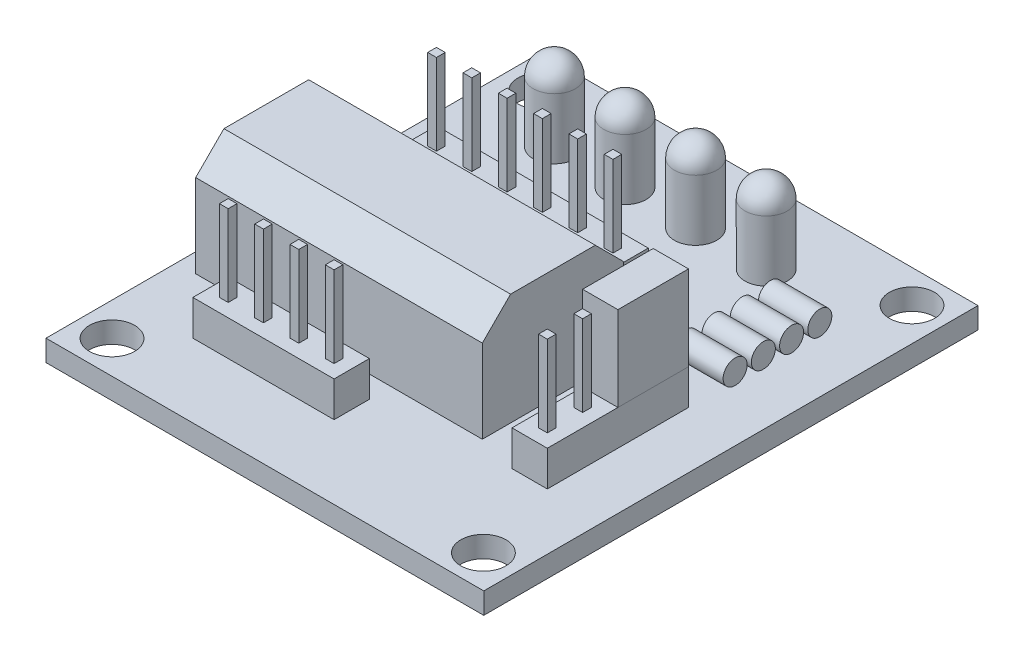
from build123d import *

# Parameters (mm, degrees)
SKETCH1_W              = 31
SKETCH1_H              = 35
SKETCH1_R              = 1.6
BOSS_EXTRUDE1_DEPTH    = 1.5
SKETCH2_W              = 20.3
SKETCH2_H              = 10
BOSS_EXTRUDE2_DEPTH    = 7.9
SKETCH3_R              = 1.5
BOSS_EXTRUDE3_DEPTH    = 5.8
FILLET1_R              = 1.5
LPATTERN1_COUNT        = 4
LPATTERN1_PITCH        = 5
FILLET1_OF_LPATTERN1_R = 1.5
BOSS_EXTRUDE4_START    = -3.7
SKETCH4_R              = 0.85
BOSS_EXTRUDE4_DEPTH    = 3.5
LPATTERN2_COUNT        = 4
LPATTERN2_PITCH        = 2
CHAMFER1_SIZE          = 2
SKETCH5_W              = 2.5
SKETCH5_H              = 2.5
BOSS_EXTRUDE5_DEPTH    = 2.5
SKETCH6_W              = 0.62
SKETCH6_H              = 0.62
BOSS_EXTRUDE6_DEPTH    = 5.75
SKETCH7_W              = 2.5
SKETCH7_H              = 2.5
BOSS_EXTRUDE7_DEPTH    = 2.5
SKETCH8_W              = 0.62
SKETCH8_H              = 0.62
BOSS_EXTRUDE8_DEPTH    = 5.75
SKETCH9_W              = 2.5
SKETCH9_H              = 2.5
BOSS_EXTRUDE9_DEPTH    = 2.5
SKETCH10_W             = 0.62
SKETCH10_H             = 0.62
BOSS_EXTRUDE10_DEPTH   = 5.75
LPATTERN3_COUNT        = 4
LPATTERN3_PITCH        = 2.5
LPATTERN4_COUNT        = 4
LPATTERN4_PITCH        = 2.5
LPATTERN5_COUNT        = 6
LPATTERN5_PITCH        = 2.5
SKETCH11_W             = 2.5
SKETCH11_H             = 5
BOSS_EXTRUDE11_DEPTH   = 6


with BuildPart() as part:
    # Sketch1 → Boss-Extrude1 (new body)
    with BuildSketch(Plane(origin=(0, 0, 0), x_dir=(1, 0, 0), z_dir=(0, 1, 0))):
        Rectangle(SKETCH1_W, SKETCH1_H)
        with Locations(Location((-13.15, 15.175, 0), (0, 0, 270))):
            Circle(SKETCH1_R, mode=Mode.SUBTRACT)
        with Locations(Location((13.15, 15.175, 0), (0, 0, 270))):
            Circle(SKETCH1_R, mode=Mode.SUBTRACT)
        with Locations(Location((13.15, -15.175, 0), (0, 0, 270))):
            Circle(SKETCH1_R, mode=Mode.SUBTRACT)
        with Locations(Location((-13.15, -15.175, 0), (0, 0, 270))):
            Circle(SKETCH1_R, mode=Mode.SUBTRACT)
    extrude(amount=BOSS_EXTRUDE1_DEPTH)

    # Sketch2 → Boss-Extrude2 (add)
    with BuildSketch(Plane(origin=(0, 1.5, 0), x_dir=(1, 0, 0), z_dir=(0, 1, 0))):
        with Locations((-4, -3.25)):
            Rectangle(SKETCH2_W, SKETCH2_H)
    extrude(amount=BOSS_EXTRUDE2_DEPTH)

    # Sketch3 → Boss-Extrude3 (add)
    with BuildSketch(Plane(origin=(0, 1.5, 0), x_dir=(1, 0, 0), z_dir=(0, 1, 0))):
        with Locations(Location((-9.25, 12.25, 0), (0, 0, 270))):
            Circle(SKETCH3_R)
    boss_extrude3 = extrude(amount=BOSS_EXTRUDE3_DEPTH)

    # Fillet1
    fillet1_edges = [part.edges().sort_by_distance(p)[0] for p in [
        (-9.25, 7.3, -13.75),
    ]]
    fillet(fillet1_edges, radius=FILLET1_R)

    # LPattern1: Boss-Extrude3 ×4
    with Locations(*[(i * LPATTERN1_PITCH, 0, 0) for i in range(1, LPATTERN1_COUNT)]):
        add(boss_extrude3)

    # Fillet1 of LPattern1
    fillet1_of_lpattern1_edges = [part.edges().sort_by_distance(p)[0] for p in [
        (-4.25, 7.3, -13.75),
        (0.75, 7.3, -13.75),
        (5.75, 7.3, -13.75),
    ]]
    fillet(fillet1_of_lpattern1_edges, radius=FILLET1_OF_LPATTERN1_R)

    # Sketch4 → Boss-Extrude4 (add)
    with BuildSketch(Plane(origin=(15.5, 0, 0), x_dir=(0, 0, -1), z_dir=(1, 0, 0)).offset(BOSS_EXTRUDE4_START)):
        with Locations((10, 2.34)):
            Circle(SKETCH4_R)
    boss_extrude4 = extrude(amount=-BOSS_EXTRUDE4_DEPTH)

    # LPattern2: Boss-Extrude4 ×4
    with Locations(*[(0, 0, i * LPATTERN2_PITCH) for i in range(1, LPATTERN2_COUNT)]):
        add(boss_extrude4)

    # Chamfer1
    chamfer1_edges = [part.edges().sort_by_distance(p)[0] for p in [
        (-4, 9.4, 8.25),
        (-4, 9.4, -1.75),
    ]]
    chamfer(chamfer1_edges, length=CHAMFER1_SIZE)

    # Sketch5 → Boss-Extrude5 (add)
    with BuildSketch(Plane(origin=(0, 1.5, 0), x_dir=(1, 0, 0), z_dir=(0, 1, 0))):
        with Locations((-9.05, -11.05)):
            Rectangle(SKETCH5_W, SKETCH5_H)
    boss_extrude5 = extrude(amount=BOSS_EXTRUDE5_DEPTH)

    # Sketch6 → Boss-Extrude6 (add)
    with BuildSketch(Plane(origin=(0, 4, 0), x_dir=(1, 0, 0), z_dir=(0, 1, 0))):
        with Locations((-9.05, -11.05)):
            Rectangle(SKETCH6_W, SKETCH6_H)
    boss_extrude6 = extrude(amount=BOSS_EXTRUDE6_DEPTH)

    # Sketch7 → Boss-Extrude7 (add)
    with BuildSketch(Plane(origin=(0, 1.5, 0), x_dir=(1, 0, 0), z_dir=(0, 1, 0))):
        with Locations((10.25, -7.75)):
            Rectangle(SKETCH7_W, SKETCH7_H)
    boss_extrude7 = extrude(amount=BOSS_EXTRUDE7_DEPTH)

    # Sketch8 → Boss-Extrude8 (add)
    with BuildSketch(Plane(origin=(0, 4, 0), x_dir=(1, 0, 0), z_dir=(0, 1, 0))):
        with Locations((10.25, -7.75)):
            Rectangle(SKETCH8_W, SKETCH8_H)
    boss_extrude8 = extrude(amount=BOSS_EXTRUDE8_DEPTH)

    # Sketch9 → Boss-Extrude9 (add)
    with BuildSketch(Plane(origin=(0, 1.5, 0), x_dir=(1, 0, 0), z_dir=(0, 1, 0))):
        with Locations((-10.95, 5.6)):
            Rectangle(SKETCH9_W, SKETCH9_H)
    boss_extrude9 = extrude(amount=BOSS_EXTRUDE9_DEPTH)

    # Sketch10 → Boss-Extrude10 (add)
    with BuildSketch(Plane(origin=(0, 4, 0), x_dir=(1, 0, 0), z_dir=(0, 1, 0))):
        with Locations((-10.95, 5.6)):
            Rectangle(SKETCH10_W, SKETCH10_H)
    boss_extrude10 = extrude(amount=BOSS_EXTRUDE10_DEPTH)

    # LPattern3: Boss-Extrude5, Boss-Extrude6 ×4
    with Locations(*[(i * LPATTERN3_PITCH, 0, 0) for i in range(1, LPATTERN3_COUNT)]):
        add(boss_extrude5)
        add(boss_extrude6)

    # LPattern4: Boss-Extrude7, Boss-Extrude8 ×4
    with Locations(*[(0, 0, -i * LPATTERN4_PITCH) for i in range(1, LPATTERN4_COUNT)]):
        add(boss_extrude7)
        add(boss_extrude8)

    # LPattern5: Boss-Extrude9, Boss-Extrude10 ×6
    with Locations(*[(i * LPATTERN5_PITCH, 0, 0) for i in range(1, LPATTERN5_COUNT)]):
        add(boss_extrude9)
        add(boss_extrude10)


with BuildPart() as body_2:
    # Sketch11 → Boss-Extrude11 (new body)
    with BuildSketch(Plane(origin=(0, 4, 0), x_dir=(1, 0, 0), z_dir=(0, 1, 0))):
        with Locations((10.25, -1.5)):
            Rectangle(SKETCH11_W, SKETCH11_H)
    extrude(amount=BOSS_EXTRUDE11_DEPTH)


solid = Compound([part.part, body_2.part])
